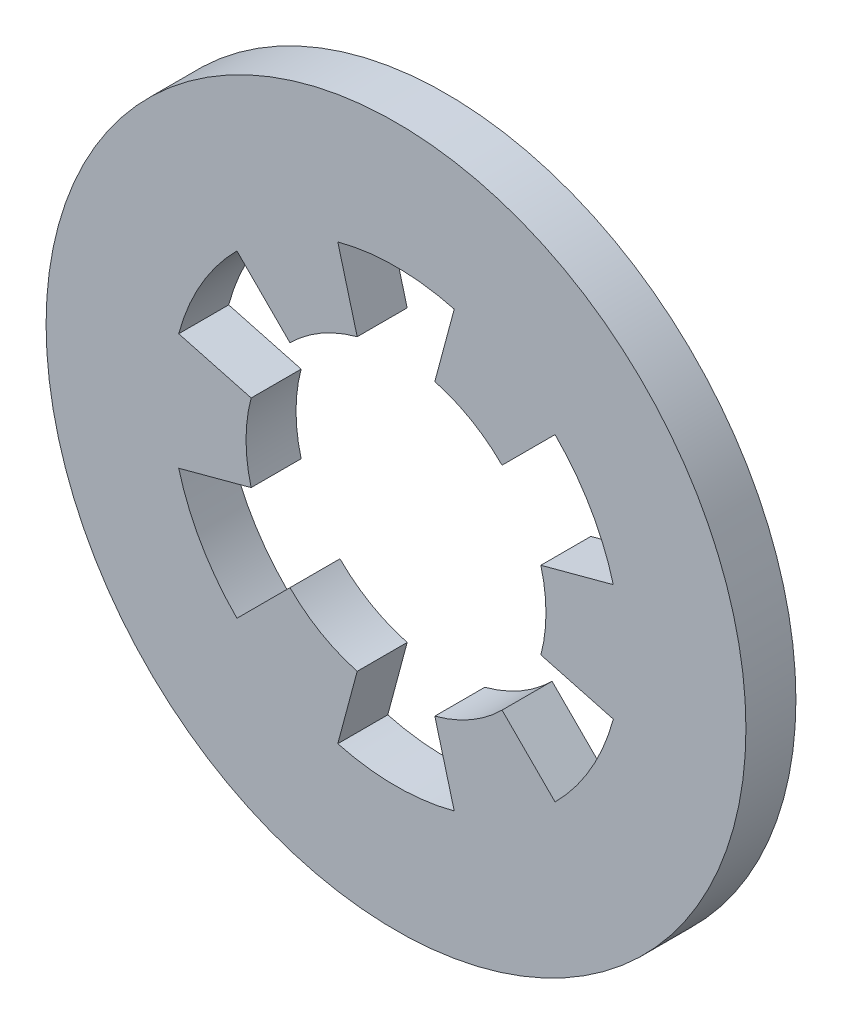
ISO-10303-21;
HEADER;
FILE_DESCRIPTION(('STEP AP214'),'2;1');
FILE_NAME('part.step','',(''),(''),'','','');
FILE_SCHEMA(('AUTOMOTIVE_DESIGN { 1 0 10303 214 1 1 1 1 }'));
ENDSEC;
DATA;
#1=APPLICATION_CONTEXT('core data for automotive mechanical design processes');
#2=APPLICATION_PROTOCOL_DEFINITION('international standard','automotive_design',2000,#1);
#3=PRODUCT_CONTEXT('',#1,'mechanical');
#4=PRODUCT('Part','Part','',(#3));
#5=PRODUCT_RELATED_PRODUCT_CATEGORY('part','',(#4));
#6=PRODUCT_DEFINITION_FORMATION('','',#4);
#7=PRODUCT_DEFINITION_CONTEXT('part definition',#1,'design');
#8=PRODUCT_DEFINITION('design','',#6,#7);
#9=PRODUCT_DEFINITION_SHAPE('','',#8);
#10=(LENGTH_UNIT() NAMED_UNIT(*) SI_UNIT(.MILLI.,.METRE.));
#11=(NAMED_UNIT(*) PLANE_ANGLE_UNIT() SI_UNIT($,.RADIAN.));
#12=(NAMED_UNIT(*) SI_UNIT($,.STERADIAN.) SOLID_ANGLE_UNIT());
#13=UNCERTAINTY_MEASURE_WITH_UNIT(LENGTH_MEASURE(1.E-05),#10,'distance_accuracy_value','');
#14=(GEOMETRIC_REPRESENTATION_CONTEXT(3) GLOBAL_UNCERTAINTY_ASSIGNED_CONTEXT((#13)) GLOBAL_UNIT_ASSIGNED_CONTEXT((#10,
#11,#12)) REPRESENTATION_CONTEXT('',''));
#15=CARTESIAN_POINT('',(0.,0.,0.));
#16=DIRECTION('',(0.,0.,1.));
#17=DIRECTION('',(1.,0.,0.));
#18=AXIS2_PLACEMENT_3D('',#15,#16,#17);
#19=CARTESIAN_POINT('',(0.,0.,-0.25));
#20=DIRECTION('',(0.,0.,-1.));
#21=DIRECTION('',(-1.,0.,0.));
#22=AXIS2_PLACEMENT_3D('',#19,#20,#21);
#23=PLANE('',#22);
#24=DIRECTION('',(-0.258819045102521,0.965925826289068,0.));
#25=VECTOR('',#24,1.);
#26=CARTESIAN_POINT('',(0.582342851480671,-2.1733331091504,-0.25));
#27=LINE('',#26,#25);
#28=CARTESIAN_POINT('',(0.582342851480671,-2.1733331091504,-0.25));
#29=VERTEX_POINT('',#28);
#30=CARTESIAN_POINT('',(0.38822856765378,-1.4488887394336,-0.25));
#31=VERTEX_POINT('',#30);
#32=EDGE_CURVE('E200',#29,#31,#27,.T.);
#33=ORIENTED_EDGE('',*,*,#32,.T.);
#34=CARTESIAN_POINT('',(0.,0.,-0.25));
#35=DIRECTION('',(0.,0.,1.));
#36=DIRECTION('',(1.,0.,0.));
#37=AXIS2_PLACEMENT_3D('',#34,#35,#36);
#38=CIRCLE('',#37,1.5);
#39=CARTESIAN_POINT('',(1.06066017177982,-1.06066017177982,-0.25));
#40=VERTEX_POINT('',#39);
#41=EDGE_CURVE('E187',#31,#40,#38,.T.);
#42=ORIENTED_EDGE('',*,*,#41,.T.);
#43=DIRECTION('',(0.707106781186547,-0.707106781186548,0.));
#44=VECTOR('',#43,1.);
#45=CARTESIAN_POINT('',(0.,0.,-0.25));
#46=LINE('',#45,#44);
#47=CARTESIAN_POINT('',(1.59099025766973,-1.59099025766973,-0.25));
#48=VERTEX_POINT('',#47);
#49=EDGE_CURVE('E186',#40,#48,#46,.T.);
#50=ORIENTED_EDGE('',*,*,#49,.T.);
#51=CARTESIAN_POINT('',(0.,0.,-0.25));
#52=DIRECTION('',(0.,0.,-1.));
#53=DIRECTION('',(-1.,0.,0.));
#54=AXIS2_PLACEMENT_3D('',#51,#52,#53);
#55=CIRCLE('',#54,2.25);
#56=CARTESIAN_POINT('',(2.1733331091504,-0.582342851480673,-0.25));
#57=VERTEX_POINT('',#56);
#58=EDGE_CURVE('E175',#48,#57,#55,.F.);
#59=ORIENTED_EDGE('',*,*,#58,.T.);
#60=DIRECTION('',(-0.965925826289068,0.258819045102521,0.));
#61=VECTOR('',#60,1.);
#62=CARTESIAN_POINT('',(2.1733331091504,-0.582342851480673,-0.25));
#63=LINE('',#62,#61);
#64=CARTESIAN_POINT('',(1.4488887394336,-0.388228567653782,-0.25));
#65=VERTEX_POINT('',#64);
#66=EDGE_CURVE('E241',#57,#65,#63,.T.);
#67=ORIENTED_EDGE('',*,*,#66,.T.);
#68=CARTESIAN_POINT('',(0.,0.,-0.25));
#69=DIRECTION('',(0.,0.,1.));
#70=DIRECTION('',(1.,0.,0.));
#71=AXIS2_PLACEMENT_3D('',#68,#69,#70);
#72=CIRCLE('',#71,1.5);
#73=CARTESIAN_POINT('',(1.4488887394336,0.38822856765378,-0.25));
#74=VERTEX_POINT('',#73);
#75=EDGE_CURVE('E243',#65,#74,#72,.T.);
#76=ORIENTED_EDGE('',*,*,#75,.T.);
#77=DIRECTION('',(0.965925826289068,0.25881904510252,0.));
#78=VECTOR('',#77,1.);
#79=CARTESIAN_POINT('',(0.,0.,-0.25));
#80=LINE('',#79,#78);
#81=CARTESIAN_POINT('',(2.1733331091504,0.582342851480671,-0.25));
#82=VERTEX_POINT('',#81);
#83=EDGE_CURVE('E237',#74,#82,#80,.T.);
#84=ORIENTED_EDGE('',*,*,#83,.T.);
#85=CARTESIAN_POINT('',(0.,0.,-0.25));
#86=DIRECTION('',(0.,0.,-1.));
#87=DIRECTION('',(-1.,0.,0.));
#88=AXIS2_PLACEMENT_3D('',#85,#86,#87);
#89=CIRCLE('',#88,2.25);
#90=CARTESIAN_POINT('',(1.59099025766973,1.59099025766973,-0.25));
#91=VERTEX_POINT('',#90);
#92=EDGE_CURVE('E305',#82,#91,#89,.F.);
#93=ORIENTED_EDGE('',*,*,#92,.T.);
#94=DIRECTION('',(-0.707106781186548,-0.707106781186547,0.));
#95=VECTOR('',#94,1.);
#96=CARTESIAN_POINT('',(1.59099025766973,1.59099025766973,-0.25));
#97=LINE('',#96,#95);
#98=CARTESIAN_POINT('',(1.06066017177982,1.06066017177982,-0.25));
#99=VERTEX_POINT('',#98);
#100=EDGE_CURVE('E232',#91,#99,#97,.T.);
#101=ORIENTED_EDGE('',*,*,#100,.T.);
#102=CARTESIAN_POINT('',(0.,0.,-0.25));
#103=DIRECTION('',(0.,0.,1.));
#104=DIRECTION('',(1.,0.,0.));
#105=AXIS2_PLACEMENT_3D('',#102,#103,#104);
#106=CIRCLE('',#105,1.5);
#107=CARTESIAN_POINT('',(0.38822856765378,1.4488887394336,-0.25));
#108=VERTEX_POINT('',#107);
#109=EDGE_CURVE('E235',#99,#108,#106,.T.);
#110=ORIENTED_EDGE('',*,*,#109,.T.);
#111=DIRECTION('',(0.25881904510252,0.965925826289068,0.));
#112=VECTOR('',#111,1.);
#113=CARTESIAN_POINT('',(0.,0.,-0.25));
#114=LINE('',#113,#112);
#115=CARTESIAN_POINT('',(0.582342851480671,2.1733331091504,-0.25));
#116=VERTEX_POINT('',#115);
#117=EDGE_CURVE('E228',#108,#116,#114,.T.);
#118=ORIENTED_EDGE('',*,*,#117,.T.);
#119=CARTESIAN_POINT('',(0.,0.,-0.25));
#120=DIRECTION('',(0.,0.,-1.));
#121=DIRECTION('',(-1.,0.,0.));
#122=AXIS2_PLACEMENT_3D('',#119,#120,#121);
#123=CIRCLE('',#122,2.25);
#124=CARTESIAN_POINT('',(-0.582342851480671,2.1733331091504,-0.25));
#125=VERTEX_POINT('',#124);
#126=EDGE_CURVE('E301',#116,#125,#123,.F.);
#127=ORIENTED_EDGE('',*,*,#126,.T.);
#128=DIRECTION('',(0.258819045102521,-0.965925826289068,0.));
#129=VECTOR('',#128,1.);
#130=CARTESIAN_POINT('',(-0.582342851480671,2.1733331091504,-0.25));
#131=LINE('',#130,#129);
#132=CARTESIAN_POINT('',(-0.388228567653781,1.4488887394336,-0.25));
#133=VERTEX_POINT('',#132);
#134=EDGE_CURVE('E224',#125,#133,#131,.T.);
#135=ORIENTED_EDGE('',*,*,#134,.T.);
#136=CARTESIAN_POINT('',(0.,0.,-0.25));
#137=DIRECTION('',(0.,0.,1.));
#138=DIRECTION('',(1.,0.,0.));
#139=AXIS2_PLACEMENT_3D('',#136,#137,#138);
#140=CIRCLE('',#139,1.5);
#141=CARTESIAN_POINT('',(-1.06066017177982,1.06066017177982,-0.25));
#142=VERTEX_POINT('',#141);
#143=EDGE_CURVE('E299',#133,#142,#140,.T.);
#144=ORIENTED_EDGE('',*,*,#143,.T.);
#145=DIRECTION('',(-0.707106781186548,0.707106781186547,0.));
#146=VECTOR('',#145,1.);
#147=CARTESIAN_POINT('',(0.,0.,-0.25));
#148=LINE('',#147,#146);
#149=CARTESIAN_POINT('',(-1.59099025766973,1.59099025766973,-0.25));
#150=VERTEX_POINT('',#149);
#151=EDGE_CURVE('E220',#142,#150,#148,.T.);
#152=ORIENTED_EDGE('',*,*,#151,.T.);
#153=CARTESIAN_POINT('',(0.,0.,-0.25));
#154=DIRECTION('',(0.,0.,-1.));
#155=DIRECTION('',(-1.,0.,0.));
#156=AXIS2_PLACEMENT_3D('',#153,#154,#155);
#157=CIRCLE('',#156,2.25);
#158=CARTESIAN_POINT('',(-2.1733331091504,0.582342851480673,-0.25));
#159=VERTEX_POINT('',#158);
#160=EDGE_CURVE('E297',#150,#159,#157,.F.);
#161=ORIENTED_EDGE('',*,*,#160,.T.);
#162=DIRECTION('',(0.965925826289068,-0.258819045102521,0.));
#163=VECTOR('',#162,1.);
#164=CARTESIAN_POINT('',(-2.1733331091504,0.582342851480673,-0.25));
#165=LINE('',#164,#163);
#166=CARTESIAN_POINT('',(-1.4488887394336,0.388228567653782,-0.25));
#167=VERTEX_POINT('',#166);
#168=EDGE_CURVE('E216',#159,#167,#165,.T.);
#169=ORIENTED_EDGE('',*,*,#168,.T.);
#170=CARTESIAN_POINT('',(0.,0.,-0.25));
#171=DIRECTION('',(0.,0.,1.));
#172=DIRECTION('',(1.,0.,0.));
#173=AXIS2_PLACEMENT_3D('',#170,#171,#172);
#174=CIRCLE('',#173,1.5);
#175=CARTESIAN_POINT('',(-1.4488887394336,-0.388228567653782,-0.25));
#176=VERTEX_POINT('',#175);
#177=EDGE_CURVE('E295',#167,#176,#174,.T.);
#178=ORIENTED_EDGE('',*,*,#177,.T.);
#179=DIRECTION('',(-0.965925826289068,-0.258819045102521,0.));
#180=VECTOR('',#179,1.);
#181=CARTESIAN_POINT('',(0.,0.,-0.25));
#182=LINE('',#181,#180);
#183=CARTESIAN_POINT('',(-2.1733331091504,-0.582342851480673,-0.25));
#184=VERTEX_POINT('',#183);
#185=EDGE_CURVE('E212',#176,#184,#182,.T.);
#186=ORIENTED_EDGE('',*,*,#185,.T.);
#187=CARTESIAN_POINT('',(0.,0.,-0.25));
#188=DIRECTION('',(0.,0.,-1.));
#189=DIRECTION('',(-1.,0.,0.));
#190=AXIS2_PLACEMENT_3D('',#187,#188,#189);
#191=CIRCLE('',#190,2.25);
#192=CARTESIAN_POINT('',(-1.59099025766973,-1.59099025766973,-0.25));
#193=VERTEX_POINT('',#192);
#194=EDGE_CURVE('E293',#184,#193,#191,.F.);
#195=ORIENTED_EDGE('',*,*,#194,.T.);
#196=DIRECTION('',(0.707106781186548,0.707106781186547,0.));
#197=VECTOR('',#196,1.);
#198=CARTESIAN_POINT('',(-1.59099025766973,-1.59099025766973,-0.25));
#199=LINE('',#198,#197);
#200=CARTESIAN_POINT('',(-1.06066017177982,-1.06066017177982,-0.25));
#201=VERTEX_POINT('',#200);
#202=EDGE_CURVE('E208',#193,#201,#199,.T.);
#203=ORIENTED_EDGE('',*,*,#202,.T.);
#204=CARTESIAN_POINT('',(0.,0.,-0.25));
#205=DIRECTION('',(0.,0.,1.));
#206=DIRECTION('',(1.,0.,0.));
#207=AXIS2_PLACEMENT_3D('',#204,#205,#206);
#208=CIRCLE('',#207,1.5);
#209=CARTESIAN_POINT('',(-0.388228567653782,-1.4488887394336,-0.25));
#210=VERTEX_POINT('',#209);
#211=EDGE_CURVE('E291',#201,#210,#208,.T.);
#212=ORIENTED_EDGE('',*,*,#211,.T.);
#213=DIRECTION('',(-0.258819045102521,-0.965925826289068,0.));
#214=VECTOR('',#213,1.);
#215=CARTESIAN_POINT('',(0.,0.,-0.25));
#216=LINE('',#215,#214);
#217=CARTESIAN_POINT('',(-0.582342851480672,-2.1733331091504,-0.25));
#218=VERTEX_POINT('',#217);
#219=EDGE_CURVE('E204',#210,#218,#216,.T.);
#220=ORIENTED_EDGE('',*,*,#219,.T.);
#221=CARTESIAN_POINT('',(0.,0.,-0.25));
#222=DIRECTION('',(0.,0.,-1.));
#223=DIRECTION('',(-1.,0.,0.));
#224=AXIS2_PLACEMENT_3D('',#221,#222,#223);
#225=CIRCLE('',#224,2.25);
#226=EDGE_CURVE('E289',#218,#29,#225,.F.);
#227=ORIENTED_EDGE('',*,*,#226,.T.);
#228=EDGE_LOOP('',(#33,#42,#50,#59,#67,#76,#84,#93,#101,#110,#118,#127,#135,#144,#152,#161,#169,
#178,#186,#195,#203,#212,#220,#227));
#229=FACE_BOUND('',#228,.T.);
#230=CARTESIAN_POINT('',(0.,0.,-0.25));
#231=DIRECTION('',(0.,0.,1.));
#232=DIRECTION('',(1.,0.,0.));
#233=AXIS2_PLACEMENT_3D('',#230,#231,#232);
#234=CIRCLE('',#233,3.5);
#235=CARTESIAN_POINT('',(3.5,0.,-0.25));
#236=VERTEX_POINT('',#235);
#237=EDGE_CURVE('E19',#236,#236,#234,.T.);
#238=ORIENTED_EDGE('',*,*,#237,.F.);
#239=EDGE_LOOP('',(#238));
#240=FACE_BOUND('',#239,.T.);
#241=ADVANCED_FACE('F15',(#229,#240),#23,.T.);
#242=CARTESIAN_POINT('',(0.,0.,0.));
#243=DIRECTION('',(0.,0.,1.));
#244=DIRECTION('',(1.,0.,0.));
#245=AXIS2_PLACEMENT_3D('',#242,#243,#244);
#246=CYLINDRICAL_SURFACE('',#245,3.5);
#247=CARTESIAN_POINT('',(0.,0.,0.25));
#248=DIRECTION('',(0.,0.,1.));
#249=DIRECTION('',(1.,0.,0.));
#250=AXIS2_PLACEMENT_3D('',#247,#248,#249);
#251=CIRCLE('',#250,3.5);
#252=CARTESIAN_POINT('',(3.5,0.,0.25));
#253=VERTEX_POINT('',#252);
#254=EDGE_CURVE('E191',#253,#253,#251,.F.);
#255=ORIENTED_EDGE('',*,*,#254,.T.);
#256=EDGE_LOOP('',(#255));
#257=FACE_BOUND('',#256,.T.);
#258=ORIENTED_EDGE('',*,*,#237,.T.);
#259=EDGE_LOOP('',(#258));
#260=FACE_BOUND('',#259,.T.);
#261=ADVANCED_FACE('F610',(#257,#260),#246,.T.);
#262=CARTESIAN_POINT('',(0.,0.,0.25));
#263=DIRECTION('',(0.,0.,-1.));
#264=DIRECTION('',(-1.,0.,0.));
#265=AXIS2_PLACEMENT_3D('',#262,#263,#264);
#266=CYLINDRICAL_SURFACE('',#265,2.25);
#267=DIRECTION('',(0.,0.,1.));
#268=VECTOR('',#267,1.);
#269=CARTESIAN_POINT('',(1.59099025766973,-1.59099025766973,0.25));
#270=LINE('',#269,#268);
#271=CARTESIAN_POINT('',(1.59099025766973,-1.59099025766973,0.25));
#272=VERTEX_POINT('',#271);
#273=EDGE_CURVE('E179',#48,#272,#270,.T.);
#274=ORIENTED_EDGE('',*,*,#273,.T.);
#275=CARTESIAN_POINT('',(0.,0.,0.25));
#276=DIRECTION('',(0.,0.,-1.));
#277=DIRECTION('',(-1.,0.,0.));
#278=AXIS2_PLACEMENT_3D('',#275,#276,#277);
#279=CIRCLE('',#278,2.25);
#280=CARTESIAN_POINT('',(2.1733331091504,-0.582342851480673,0.25));
#281=VERTEX_POINT('',#280);
#282=EDGE_CURVE('E194',#272,#281,#279,.F.);
#283=ORIENTED_EDGE('',*,*,#282,.T.);
#284=DIRECTION('',(0.,0.,1.));
#285=VECTOR('',#284,1.);
#286=CARTESIAN_POINT('',(2.1733331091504,-0.582342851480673,0.25));
#287=LINE('',#286,#285);
#288=EDGE_CURVE('E180',#281,#57,#287,.F.);
#289=ORIENTED_EDGE('',*,*,#288,.T.);
#290=ORIENTED_EDGE('',*,*,#58,.F.);
#291=EDGE_LOOP('',(#274,#283,#289,#290));
#292=FACE_BOUND('',#291,.T.);
#293=ADVANCED_FACE('F177',(#292),#266,.F.);
#294=CARTESIAN_POINT('',(2.1733331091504,-0.582342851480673,0.25));
#295=DIRECTION('',(0.258819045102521,0.965925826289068,0.));
#296=DIRECTION('',(-0.965925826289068,0.258819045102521,0.));
#297=AXIS2_PLACEMENT_3D('',#294,#295,#296);
#298=PLANE('',#297);
#299=ORIENTED_EDGE('',*,*,#288,.F.);
#300=DIRECTION('',(-0.965925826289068,0.258819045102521,0.));
#301=VECTOR('',#300,1.);
#302=CARTESIAN_POINT('',(2.1733331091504,-0.582342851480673,0.25));
#303=LINE('',#302,#301);
#304=CARTESIAN_POINT('',(1.4488887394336,-0.388228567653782,0.25));
#305=VERTEX_POINT('',#304);
#306=EDGE_CURVE('E286',#281,#305,#303,.T.);
#307=ORIENTED_EDGE('',*,*,#306,.T.);
#308=DIRECTION('',(0.,0.,1.));
#309=VECTOR('',#308,1.);
#310=CARTESIAN_POINT('',(1.4488887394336,-0.388228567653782,0.));
#311=LINE('',#310,#309);
#312=EDGE_CURVE('E307',#305,#65,#311,.F.);
#313=ORIENTED_EDGE('',*,*,#312,.T.);
#314=ORIENTED_EDGE('',*,*,#66,.F.);
#315=EDGE_LOOP('',(#299,#307,#313,#314));
#316=FACE_BOUND('',#315,.T.);
#317=ADVANCED_FACE('F454',(#316),#298,.F.);
#318=CARTESIAN_POINT('',(0.,0.,0.));
#319=DIRECTION('',(0.,0.,1.));
#320=DIRECTION('',(1.,0.,0.));
#321=AXIS2_PLACEMENT_3D('',#318,#319,#320);
#322=CYLINDRICAL_SURFACE('',#321,1.5);
#323=CARTESIAN_POINT('',(0.,0.,0.25));
#324=DIRECTION('',(0.,0.,1.));
#325=DIRECTION('',(1.,0.,0.));
#326=AXIS2_PLACEMENT_3D('',#323,#324,#325);
#327=CIRCLE('',#326,1.5);
#328=CARTESIAN_POINT('',(1.4488887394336,0.388228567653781,0.25));
#329=VERTEX_POINT('',#328);
#330=EDGE_CURVE('E283',#305,#329,#327,.T.);
#331=ORIENTED_EDGE('',*,*,#330,.T.);
#332=DIRECTION('',(0.,0.,1.));
#333=VECTOR('',#332,1.);
#334=CARTESIAN_POINT('',(1.4488887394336,0.38822856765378,0.25));
#335=LINE('',#334,#333);
#336=EDGE_CURVE('E240',#329,#74,#335,.F.);
#337=ORIENTED_EDGE('',*,*,#336,.T.);
#338=ORIENTED_EDGE('',*,*,#75,.F.);
#339=ORIENTED_EDGE('',*,*,#312,.F.);
#340=EDGE_LOOP('',(#331,#337,#338,#339));
#341=FACE_BOUND('',#340,.T.);
#342=ADVANCED_FACE('F453',(#341),#322,.F.);
#343=CARTESIAN_POINT('',(0.,0.,0.25));
#344=DIRECTION('',(0.25881904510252,-0.965925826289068,0.));
#345=DIRECTION('',(0.965925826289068,0.25881904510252,0.));
#346=AXIS2_PLACEMENT_3D('',#343,#344,#345);
#347=PLANE('',#346);
#348=ORIENTED_EDGE('',*,*,#336,.F.);
#349=DIRECTION('',(0.965925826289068,0.25881904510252,0.));
#350=VECTOR('',#349,1.);
#351=CARTESIAN_POINT('',(1.4488887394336,0.388228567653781,0.25));
#352=LINE('',#351,#350);
#353=CARTESIAN_POINT('',(2.1733331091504,0.582342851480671,0.25));
#354=VERTEX_POINT('',#353);
#355=EDGE_CURVE('E282',#329,#354,#352,.T.);
#356=ORIENTED_EDGE('',*,*,#355,.T.);
#357=DIRECTION('',(0.,0.,-1.));
#358=VECTOR('',#357,1.);
#359=CARTESIAN_POINT('',(2.1733331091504,0.582342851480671,0.25));
#360=LINE('',#359,#358);
#361=EDGE_CURVE('E239',#354,#82,#360,.T.);
#362=ORIENTED_EDGE('',*,*,#361,.T.);
#363=ORIENTED_EDGE('',*,*,#83,.F.);
#364=EDGE_LOOP('',(#348,#356,#362,#363));
#365=FACE_BOUND('',#364,.T.);
#366=ADVANCED_FACE('F449',(#365),#347,.F.);
#367=CARTESIAN_POINT('',(0.,0.,0.25));
#368=DIRECTION('',(0.,0.,-1.));
#369=DIRECTION('',(-1.,0.,0.));
#370=AXIS2_PLACEMENT_3D('',#367,#368,#369);
#371=CYLINDRICAL_SURFACE('',#370,2.25);
#372=ORIENTED_EDGE('',*,*,#361,.F.);
#373=CARTESIAN_POINT('',(0.,0.,0.25));
#374=DIRECTION('',(0.,0.,-1.));
#375=DIRECTION('',(-1.,0.,0.));
#376=AXIS2_PLACEMENT_3D('',#373,#374,#375);
#377=CIRCLE('',#376,2.25);
#378=CARTESIAN_POINT('',(1.59099025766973,1.59099025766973,0.25));
#379=VERTEX_POINT('',#378);
#380=EDGE_CURVE('E279',#354,#379,#377,.F.);
#381=ORIENTED_EDGE('',*,*,#380,.T.);
#382=DIRECTION('',(0.,0.,1.));
#383=VECTOR('',#382,1.);
#384=CARTESIAN_POINT('',(1.59099025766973,1.59099025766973,0.25));
#385=LINE('',#384,#383);
#386=EDGE_CURVE('E236',#379,#91,#385,.F.);
#387=ORIENTED_EDGE('',*,*,#386,.T.);
#388=ORIENTED_EDGE('',*,*,#92,.F.);
#389=EDGE_LOOP('',(#372,#381,#387,#388));
#390=FACE_BOUND('',#389,.T.);
#391=ADVANCED_FACE('F446',(#390),#371,.F.);
#392=CARTESIAN_POINT('',(1.59099025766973,1.59099025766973,0.25));
#393=DIRECTION('',(-0.707106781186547,0.707106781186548,0.));
#394=DIRECTION('',(-0.707106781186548,-0.707106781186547,0.));
#395=AXIS2_PLACEMENT_3D('',#392,#393,#394);
#396=PLANE('',#395);
#397=ORIENTED_EDGE('',*,*,#386,.F.);
#398=DIRECTION('',(-0.707106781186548,-0.707106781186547,0.));
#399=VECTOR('',#398,1.);
#400=CARTESIAN_POINT('',(1.59099025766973,1.59099025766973,0.25));
#401=LINE('',#400,#399);
#402=CARTESIAN_POINT('',(1.06066017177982,1.06066017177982,0.25));
#403=VERTEX_POINT('',#402);
#404=EDGE_CURVE('E278',#379,#403,#401,.T.);
#405=ORIENTED_EDGE('',*,*,#404,.T.);
#406=DIRECTION('',(0.,0.,1.));
#407=VECTOR('',#406,1.);
#408=CARTESIAN_POINT('',(1.06066017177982,1.06066017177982,0.));
#409=LINE('',#408,#407);
#410=EDGE_CURVE('E304',#403,#99,#409,.F.);
#411=ORIENTED_EDGE('',*,*,#410,.T.);
#412=ORIENTED_EDGE('',*,*,#100,.F.);
#413=EDGE_LOOP('',(#397,#405,#411,#412));
#414=FACE_BOUND('',#413,.T.);
#415=ADVANCED_FACE('F442',(#414),#396,.F.);
#416=CARTESIAN_POINT('',(0.,0.,0.));
#417=DIRECTION('',(0.,0.,1.));
#418=DIRECTION('',(1.,0.,0.));
#419=AXIS2_PLACEMENT_3D('',#416,#417,#418);
#420=CYLINDRICAL_SURFACE('',#419,1.5);
#421=CARTESIAN_POINT('',(0.,0.,0.25));
#422=DIRECTION('',(0.,0.,1.));
#423=DIRECTION('',(1.,0.,0.));
#424=AXIS2_PLACEMENT_3D('',#421,#422,#423);
#425=CIRCLE('',#424,1.5);
#426=CARTESIAN_POINT('',(0.388228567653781,1.4488887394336,0.25));
#427=VERTEX_POINT('',#426);
#428=EDGE_CURVE('E275',#403,#427,#425,.T.);
#429=ORIENTED_EDGE('',*,*,#428,.T.);
#430=DIRECTION('',(0.,0.,1.));
#431=VECTOR('',#430,1.);
#432=CARTESIAN_POINT('',(0.38822856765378,1.4488887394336,0.25));
#433=LINE('',#432,#431);
#434=EDGE_CURVE('E231',#427,#108,#433,.F.);
#435=ORIENTED_EDGE('',*,*,#434,.T.);
#436=ORIENTED_EDGE('',*,*,#109,.F.);
#437=ORIENTED_EDGE('',*,*,#410,.F.);
#438=EDGE_LOOP('',(#429,#435,#436,#437));
#439=FACE_BOUND('',#438,.T.);
#440=ADVANCED_FACE('F439',(#439),#420,.F.);
#441=CARTESIAN_POINT('',(0.,0.,0.25));
#442=DIRECTION('',(0.965925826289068,-0.25881904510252,0.));
#443=DIRECTION('',(0.25881904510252,0.965925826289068,0.));
#444=AXIS2_PLACEMENT_3D('',#441,#442,#443);
#445=PLANE('',#444);
#446=ORIENTED_EDGE('',*,*,#434,.F.);
#447=DIRECTION('',(0.25881904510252,0.965925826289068,0.));
#448=VECTOR('',#447,1.);
#449=CARTESIAN_POINT('',(0.388228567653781,1.4488887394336,0.25));
#450=LINE('',#449,#448);
#451=CARTESIAN_POINT('',(0.582342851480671,2.1733331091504,0.25));
#452=VERTEX_POINT('',#451);
#453=EDGE_CURVE('E274',#427,#452,#450,.T.);
#454=ORIENTED_EDGE('',*,*,#453,.T.);
#455=DIRECTION('',(0.,0.,-1.));
#456=VECTOR('',#455,1.);
#457=CARTESIAN_POINT('',(0.582342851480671,2.1733331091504,0.25));
#458=LINE('',#457,#456);
#459=EDGE_CURVE('E230',#452,#116,#458,.T.);
#460=ORIENTED_EDGE('',*,*,#459,.T.);
#461=ORIENTED_EDGE('',*,*,#117,.F.);
#462=EDGE_LOOP('',(#446,#454,#460,#461));
#463=FACE_BOUND('',#462,.T.);
#464=ADVANCED_FACE('F435',(#463),#445,.F.);
#465=CARTESIAN_POINT('',(0.,0.,0.25));
#466=DIRECTION('',(0.,0.,-1.));
#467=DIRECTION('',(-1.,0.,0.));
#468=AXIS2_PLACEMENT_3D('',#465,#466,#467);
#469=CYLINDRICAL_SURFACE('',#468,2.25);
#470=ORIENTED_EDGE('',*,*,#459,.F.);
#471=CARTESIAN_POINT('',(0.,0.,0.25));
#472=DIRECTION('',(0.,0.,-1.));
#473=DIRECTION('',(-1.,0.,0.));
#474=AXIS2_PLACEMENT_3D('',#471,#472,#473);
#475=CIRCLE('',#474,2.25);
#476=CARTESIAN_POINT('',(-0.582342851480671,2.1733331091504,0.25));
#477=VERTEX_POINT('',#476);
#478=EDGE_CURVE('E271',#452,#477,#475,.F.);
#479=ORIENTED_EDGE('',*,*,#478,.T.);
#480=DIRECTION('',(0.,0.,1.));
#481=VECTOR('',#480,1.);
#482=CARTESIAN_POINT('',(-0.582342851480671,2.1733331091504,0.25));
#483=LINE('',#482,#481);
#484=EDGE_CURVE('E227',#477,#125,#483,.F.);
#485=ORIENTED_EDGE('',*,*,#484,.T.);
#486=ORIENTED_EDGE('',*,*,#126,.F.);
#487=EDGE_LOOP('',(#470,#479,#485,#486));
#488=FACE_BOUND('',#487,.T.);
#489=ADVANCED_FACE('F431',(#488),#469,.F.);
#490=CARTESIAN_POINT('',(-0.582342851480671,2.1733331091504,0.25));
#491=DIRECTION('',(-0.965925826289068,-0.258819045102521,0.));
#492=DIRECTION('',(0.258819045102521,-0.965925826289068,0.));
#493=AXIS2_PLACEMENT_3D('',#490,#491,#492);
#494=PLANE('',#493);
#495=ORIENTED_EDGE('',*,*,#484,.F.);
#496=DIRECTION('',(0.25881904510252,-0.965925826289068,0.));
#497=VECTOR('',#496,1.);
#498=CARTESIAN_POINT('',(-0.582342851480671,2.1733331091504,0.25));
#499=LINE('',#498,#497);
#500=CARTESIAN_POINT('',(-0.388228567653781,1.4488887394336,0.25));
#501=VERTEX_POINT('',#500);
#502=EDGE_CURVE('E270',#477,#501,#499,.T.);
#503=ORIENTED_EDGE('',*,*,#502,.T.);
#504=DIRECTION('',(0.,0.,1.));
#505=VECTOR('',#504,1.);
#506=CARTESIAN_POINT('',(-0.388228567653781,1.4488887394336,0.));
#507=LINE('',#506,#505);
#508=EDGE_CURVE('E226',#501,#133,#507,.F.);
#509=ORIENTED_EDGE('',*,*,#508,.T.);
#510=ORIENTED_EDGE('',*,*,#134,.F.);
#511=EDGE_LOOP('',(#495,#503,#509,#510));
#512=FACE_BOUND('',#511,.T.);
#513=ADVANCED_FACE('F427',(#512),#494,.F.);
#514=CARTESIAN_POINT('',(0.,0.,0.));
#515=DIRECTION('',(0.,0.,1.));
#516=DIRECTION('',(1.,0.,0.));
#517=AXIS2_PLACEMENT_3D('',#514,#515,#516);
#518=CYLINDRICAL_SURFACE('',#517,1.5);
#519=ORIENTED_EDGE('',*,*,#143,.F.);
#520=ORIENTED_EDGE('',*,*,#508,.F.);
#521=CARTESIAN_POINT('',(0.,0.,0.25));
#522=DIRECTION('',(0.,0.,1.));
#523=DIRECTION('',(1.,0.,0.));
#524=AXIS2_PLACEMENT_3D('',#521,#522,#523);
#525=CIRCLE('',#524,1.5);
#526=CARTESIAN_POINT('',(-1.06066017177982,1.06066017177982,0.25));
#527=VERTEX_POINT('',#526);
#528=EDGE_CURVE('E267',#501,#527,#525,.T.);
#529=ORIENTED_EDGE('',*,*,#528,.T.);
#530=DIRECTION('',(0.,0.,1.));
#531=VECTOR('',#530,1.);
#532=CARTESIAN_POINT('',(-1.06066017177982,1.06066017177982,0.25));
#533=LINE('',#532,#531);
#534=EDGE_CURVE('E223',#527,#142,#533,.F.);
#535=ORIENTED_EDGE('',*,*,#534,.T.);
#536=EDGE_LOOP('',(#519,#520,#529,#535));
#537=FACE_BOUND('',#536,.T.);
#538=ADVANCED_FACE('F424',(#537),#518,.F.);
#539=CARTESIAN_POINT('',(0.,0.,0.25));
#540=DIRECTION('',(0.707106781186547,0.707106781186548,0.));
#541=DIRECTION('',(-0.707106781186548,0.707106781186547,0.));
#542=AXIS2_PLACEMENT_3D('',#539,#540,#541);
#543=PLANE('',#542);
#544=ORIENTED_EDGE('',*,*,#534,.F.);
#545=DIRECTION('',(-0.707106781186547,0.707106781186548,0.));
#546=VECTOR('',#545,1.);
#547=CARTESIAN_POINT('',(-1.06066017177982,1.06066017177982,0.25));
#548=LINE('',#547,#546);
#549=CARTESIAN_POINT('',(-1.59099025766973,1.59099025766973,0.25));
#550=VERTEX_POINT('',#549);
#551=EDGE_CURVE('E266',#527,#550,#548,.T.);
#552=ORIENTED_EDGE('',*,*,#551,.T.);
#553=DIRECTION('',(0.,0.,-1.));
#554=VECTOR('',#553,1.);
#555=CARTESIAN_POINT('',(-1.59099025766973,1.59099025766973,0.25));
#556=LINE('',#555,#554);
#557=EDGE_CURVE('E222',#550,#150,#556,.T.);
#558=ORIENTED_EDGE('',*,*,#557,.T.);
#559=ORIENTED_EDGE('',*,*,#151,.F.);
#560=EDGE_LOOP('',(#544,#552,#558,#559));
#561=FACE_BOUND('',#560,.T.);
#562=ADVANCED_FACE('F419',(#561),#543,.F.);
#563=CARTESIAN_POINT('',(0.,0.,0.25));
#564=DIRECTION('',(0.,0.,-1.));
#565=DIRECTION('',(-1.,0.,0.));
#566=AXIS2_PLACEMENT_3D('',#563,#564,#565);
#567=CYLINDRICAL_SURFACE('',#566,2.25);
#568=ORIENTED_EDGE('',*,*,#557,.F.);
#569=CARTESIAN_POINT('',(0.,0.,0.25));
#570=DIRECTION('',(0.,0.,-1.));
#571=DIRECTION('',(-1.,0.,0.));
#572=AXIS2_PLACEMENT_3D('',#569,#570,#571);
#573=CIRCLE('',#572,2.25);
#574=CARTESIAN_POINT('',(-2.1733331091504,0.582342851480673,0.25));
#575=VERTEX_POINT('',#574);
#576=EDGE_CURVE('E263',#550,#575,#573,.F.);
#577=ORIENTED_EDGE('',*,*,#576,.T.);
#578=DIRECTION('',(0.,0.,1.));
#579=VECTOR('',#578,1.);
#580=CARTESIAN_POINT('',(-2.1733331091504,0.582342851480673,0.25));
#581=LINE('',#580,#579);
#582=EDGE_CURVE('E219',#575,#159,#581,.F.);
#583=ORIENTED_EDGE('',*,*,#582,.T.);
#584=ORIENTED_EDGE('',*,*,#160,.F.);
#585=EDGE_LOOP('',(#568,#577,#583,#584));
#586=FACE_BOUND('',#585,.T.);
#587=ADVANCED_FACE('F415',(#586),#567,.F.);
#588=CARTESIAN_POINT('',(-2.1733331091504,0.582342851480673,0.25));
#589=DIRECTION('',(-0.258819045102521,-0.965925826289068,0.));
#590=DIRECTION('',(0.965925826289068,-0.258819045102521,0.));
#591=AXIS2_PLACEMENT_3D('',#588,#589,#590);
#592=PLANE('',#591);
#593=ORIENTED_EDGE('',*,*,#582,.F.);
#594=DIRECTION('',(0.965925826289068,-0.258819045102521,0.));
#595=VECTOR('',#594,1.);
#596=CARTESIAN_POINT('',(-2.1733331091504,0.582342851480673,0.25));
#597=LINE('',#596,#595);
#598=CARTESIAN_POINT('',(-1.4488887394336,0.388228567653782,0.25));
#599=VERTEX_POINT('',#598);
#600=EDGE_CURVE('E262',#575,#599,#597,.T.);
#601=ORIENTED_EDGE('',*,*,#600,.T.);
#602=DIRECTION('',(0.,0.,1.));
#603=VECTOR('',#602,1.);
#604=CARTESIAN_POINT('',(-1.4488887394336,0.388228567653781,0.));
#605=LINE('',#604,#603);
#606=EDGE_CURVE('E218',#599,#167,#605,.F.);
#607=ORIENTED_EDGE('',*,*,#606,.T.);
#608=ORIENTED_EDGE('',*,*,#168,.F.);
#609=EDGE_LOOP('',(#593,#601,#607,#608));
#610=FACE_BOUND('',#609,.T.);
#611=ADVANCED_FACE('F411',(#610),#592,.F.);
#612=CARTESIAN_POINT('',(0.,0.,0.));
#613=DIRECTION('',(0.,0.,1.));
#614=DIRECTION('',(1.,0.,0.));
#615=AXIS2_PLACEMENT_3D('',#612,#613,#614);
#616=CYLINDRICAL_SURFACE('',#615,1.5);
#617=ORIENTED_EDGE('',*,*,#177,.F.);
#618=ORIENTED_EDGE('',*,*,#606,.F.);
#619=CARTESIAN_POINT('',(0.,0.,0.25));
#620=DIRECTION('',(0.,0.,1.));
#621=DIRECTION('',(1.,0.,0.));
#622=AXIS2_PLACEMENT_3D('',#619,#620,#621);
#623=CIRCLE('',#622,1.5);
#624=CARTESIAN_POINT('',(-1.4488887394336,-0.388228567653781,0.25));
#625=VERTEX_POINT('',#624);
#626=EDGE_CURVE('E259',#599,#625,#623,.T.);
#627=ORIENTED_EDGE('',*,*,#626,.T.);
#628=DIRECTION('',(0.,0.,1.));
#629=VECTOR('',#628,1.);
#630=CARTESIAN_POINT('',(-1.4488887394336,-0.388228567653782,0.25));
#631=LINE('',#630,#629);
#632=EDGE_CURVE('E215',#625,#176,#631,.F.);
#633=ORIENTED_EDGE('',*,*,#632,.T.);
#634=EDGE_LOOP('',(#617,#618,#627,#633));
#635=FACE_BOUND('',#634,.T.);
#636=ADVANCED_FACE('F408',(#635),#616,.F.);
#637=CARTESIAN_POINT('',(0.,0.,0.25));
#638=DIRECTION('',(-0.258819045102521,0.965925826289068,0.));
#639=DIRECTION('',(-0.965925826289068,-0.258819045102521,0.));
#640=AXIS2_PLACEMENT_3D('',#637,#638,#639);
#641=PLANE('',#640);
#642=ORIENTED_EDGE('',*,*,#632,.F.);
#643=DIRECTION('',(-0.965925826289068,-0.258819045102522,0.));
#644=VECTOR('',#643,1.);
#645=CARTESIAN_POINT('',(-1.4488887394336,-0.388228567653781,0.25));
#646=LINE('',#645,#644);
#647=CARTESIAN_POINT('',(-2.1733331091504,-0.582342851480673,0.25));
#648=VERTEX_POINT('',#647);
#649=EDGE_CURVE('E258',#625,#648,#646,.T.);
#650=ORIENTED_EDGE('',*,*,#649,.T.);
#651=DIRECTION('',(0.,0.,-1.));
#652=VECTOR('',#651,1.);
#653=CARTESIAN_POINT('',(-2.1733331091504,-0.582342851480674,0.25));
#654=LINE('',#653,#652);
#655=EDGE_CURVE('E214',#648,#184,#654,.T.);
#656=ORIENTED_EDGE('',*,*,#655,.T.);
#657=ORIENTED_EDGE('',*,*,#185,.F.);
#658=EDGE_LOOP('',(#642,#650,#656,#657));
#659=FACE_BOUND('',#658,.T.);
#660=ADVANCED_FACE('F403',(#659),#641,.F.);
#661=CARTESIAN_POINT('',(0.,0.,0.25));
#662=DIRECTION('',(0.,0.,-1.));
#663=DIRECTION('',(-1.,0.,0.));
#664=AXIS2_PLACEMENT_3D('',#661,#662,#663);
#665=CYLINDRICAL_SURFACE('',#664,2.25);
#666=ORIENTED_EDGE('',*,*,#655,.F.);
#667=CARTESIAN_POINT('',(0.,0.,0.25));
#668=DIRECTION('',(0.,0.,-1.));
#669=DIRECTION('',(-1.,0.,0.));
#670=AXIS2_PLACEMENT_3D('',#667,#668,#669);
#671=CIRCLE('',#670,2.25);
#672=CARTESIAN_POINT('',(-1.59099025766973,-1.59099025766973,0.25));
#673=VERTEX_POINT('',#672);
#674=EDGE_CURVE('E255',#648,#673,#671,.F.);
#675=ORIENTED_EDGE('',*,*,#674,.T.);
#676=DIRECTION('',(0.,0.,1.));
#677=VECTOR('',#676,1.);
#678=CARTESIAN_POINT('',(-1.59099025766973,-1.59099025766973,0.25));
#679=LINE('',#678,#677);
#680=EDGE_CURVE('E211',#673,#193,#679,.F.);
#681=ORIENTED_EDGE('',*,*,#680,.T.);
#682=ORIENTED_EDGE('',*,*,#194,.F.);
#683=EDGE_LOOP('',(#666,#675,#681,#682));
#684=FACE_BOUND('',#683,.T.);
#685=ADVANCED_FACE('F399',(#684),#665,.F.);
#686=CARTESIAN_POINT('',(-1.59099025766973,-1.59099025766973,0.25));
#687=DIRECTION('',(0.707106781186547,-0.707106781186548,0.));
#688=DIRECTION('',(0.707106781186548,0.707106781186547,0.));
#689=AXIS2_PLACEMENT_3D('',#686,#687,#688);
#690=PLANE('',#689);
#691=ORIENTED_EDGE('',*,*,#680,.F.);
#692=DIRECTION('',(0.707106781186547,0.707106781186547,0.));
#693=VECTOR('',#692,1.);
#694=CARTESIAN_POINT('',(-1.59099025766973,-1.59099025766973,0.25));
#695=LINE('',#694,#693);
#696=CARTESIAN_POINT('',(-1.06066017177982,-1.06066017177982,0.25));
#697=VERTEX_POINT('',#696);
#698=EDGE_CURVE('E254',#673,#697,#695,.T.);
#699=ORIENTED_EDGE('',*,*,#698,.T.);
#700=DIRECTION('',(0.,0.,1.));
#701=VECTOR('',#700,1.);
#702=CARTESIAN_POINT('',(-1.06066017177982,-1.06066017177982,0.));
#703=LINE('',#702,#701);
#704=EDGE_CURVE('E210',#697,#201,#703,.F.);
#705=ORIENTED_EDGE('',*,*,#704,.T.);
#706=ORIENTED_EDGE('',*,*,#202,.F.);
#707=EDGE_LOOP('',(#691,#699,#705,#706));
#708=FACE_BOUND('',#707,.T.);
#709=ADVANCED_FACE('F395',(#708),#690,.F.);
#710=CARTESIAN_POINT('',(0.,0.,0.));
#711=DIRECTION('',(0.,0.,1.));
#712=DIRECTION('',(1.,0.,0.));
#713=AXIS2_PLACEMENT_3D('',#710,#711,#712);
#714=CYLINDRICAL_SURFACE('',#713,1.5);
#715=ORIENTED_EDGE('',*,*,#211,.F.);
#716=ORIENTED_EDGE('',*,*,#704,.F.);
#717=CARTESIAN_POINT('',(0.,0.,0.25));
#718=DIRECTION('',(0.,0.,1.));
#719=DIRECTION('',(1.,0.,0.));
#720=AXIS2_PLACEMENT_3D('',#717,#718,#719);
#721=CIRCLE('',#720,1.5);
#722=CARTESIAN_POINT('',(-0.388228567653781,-1.4488887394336,0.25));
#723=VERTEX_POINT('',#722);
#724=EDGE_CURVE('E251',#697,#723,#721,.T.);
#725=ORIENTED_EDGE('',*,*,#724,.T.);
#726=DIRECTION('',(0.,0.,1.));
#727=VECTOR('',#726,1.);
#728=CARTESIAN_POINT('',(-0.388228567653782,-1.4488887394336,0.25));
#729=LINE('',#728,#727);
#730=EDGE_CURVE('E207',#723,#210,#729,.F.);
#731=ORIENTED_EDGE('',*,*,#730,.T.);
#732=EDGE_LOOP('',(#715,#716,#725,#731));
#733=FACE_BOUND('',#732,.T.);
#734=ADVANCED_FACE('F392',(#733),#714,.F.);
#735=CARTESIAN_POINT('',(0.,0.,0.25));
#736=DIRECTION('',(-0.965925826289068,0.258819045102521,0.));
#737=DIRECTION('',(-0.258819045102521,-0.965925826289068,0.));
#738=AXIS2_PLACEMENT_3D('',#735,#736,#737);
#739=PLANE('',#738);
#740=ORIENTED_EDGE('',*,*,#730,.F.);
#741=DIRECTION('',(-0.25881904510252,-0.965925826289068,0.));
#742=VECTOR('',#741,1.);
#743=CARTESIAN_POINT('',(-0.388228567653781,-1.4488887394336,0.25));
#744=LINE('',#743,#742);
#745=CARTESIAN_POINT('',(-0.582342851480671,-2.1733331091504,0.25));
#746=VERTEX_POINT('',#745);
#747=EDGE_CURVE('E250',#723,#746,#744,.T.);
#748=ORIENTED_EDGE('',*,*,#747,.T.);
#749=DIRECTION('',(0.,0.,-1.));
#750=VECTOR('',#749,1.);
#751=CARTESIAN_POINT('',(-0.582342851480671,-2.1733331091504,0.25));
#752=LINE('',#751,#750);
#753=EDGE_CURVE('E206',#746,#218,#752,.T.);
#754=ORIENTED_EDGE('',*,*,#753,.T.);
#755=ORIENTED_EDGE('',*,*,#219,.F.);
#756=EDGE_LOOP('',(#740,#748,#754,#755));
#757=FACE_BOUND('',#756,.T.);
#758=ADVANCED_FACE('F387',(#757),#739,.F.);
#759=CARTESIAN_POINT('',(0.,0.,0.25));
#760=DIRECTION('',(0.,0.,-1.));
#761=DIRECTION('',(-1.,0.,0.));
#762=AXIS2_PLACEMENT_3D('',#759,#760,#761);
#763=CYLINDRICAL_SURFACE('',#762,2.25);
#764=ORIENTED_EDGE('',*,*,#753,.F.);
#765=CARTESIAN_POINT('',(0.,0.,0.25));
#766=DIRECTION('',(0.,0.,-1.));
#767=DIRECTION('',(-1.,0.,0.));
#768=AXIS2_PLACEMENT_3D('',#765,#766,#767);
#769=CIRCLE('',#768,2.25);
#770=CARTESIAN_POINT('',(0.582342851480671,-2.1733331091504,0.25));
#771=VERTEX_POINT('',#770);
#772=EDGE_CURVE('E247',#746,#771,#769,.F.);
#773=ORIENTED_EDGE('',*,*,#772,.T.);
#774=DIRECTION('',(0.,0.,1.));
#775=VECTOR('',#774,1.);
#776=CARTESIAN_POINT('',(0.582342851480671,-2.1733331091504,0.25));
#777=LINE('',#776,#775);
#778=EDGE_CURVE('E203',#771,#29,#777,.F.);
#779=ORIENTED_EDGE('',*,*,#778,.T.);
#780=ORIENTED_EDGE('',*,*,#226,.F.);
#781=EDGE_LOOP('',(#764,#773,#779,#780));
#782=FACE_BOUND('',#781,.T.);
#783=ADVANCED_FACE('F383',(#782),#763,.F.);
#784=CARTESIAN_POINT('',(0.582342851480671,-2.1733331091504,0.25));
#785=DIRECTION('',(0.965925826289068,0.258819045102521,0.));
#786=DIRECTION('',(-0.258819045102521,0.965925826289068,0.));
#787=AXIS2_PLACEMENT_3D('',#784,#785,#786);
#788=PLANE('',#787);
#789=ORIENTED_EDGE('',*,*,#778,.F.);
#790=DIRECTION('',(-0.25881904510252,0.965925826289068,0.));
#791=VECTOR('',#790,1.);
#792=CARTESIAN_POINT('',(0.582342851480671,-2.1733331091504,0.25));
#793=LINE('',#792,#791);
#794=CARTESIAN_POINT('',(0.388228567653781,-1.4488887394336,0.25));
#795=VERTEX_POINT('',#794);
#796=EDGE_CURVE('E246',#771,#795,#793,.T.);
#797=ORIENTED_EDGE('',*,*,#796,.T.);
#798=DIRECTION('',(0.,0.,1.));
#799=VECTOR('',#798,1.);
#800=CARTESIAN_POINT('',(0.38822856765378,-1.4488887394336,0.));
#801=LINE('',#800,#799);
#802=EDGE_CURVE('E202',#795,#31,#801,.F.);
#803=ORIENTED_EDGE('',*,*,#802,.T.);
#804=ORIENTED_EDGE('',*,*,#32,.F.);
#805=EDGE_LOOP('',(#789,#797,#803,#804));
#806=FACE_BOUND('',#805,.T.);
#807=ADVANCED_FACE('F375',(#806),#788,.F.);
#808=CARTESIAN_POINT('',(0.,0.,0.));
#809=DIRECTION('',(0.,0.,1.));
#810=DIRECTION('',(1.,0.,0.));
#811=AXIS2_PLACEMENT_3D('',#808,#809,#810);
#812=CYLINDRICAL_SURFACE('',#811,1.5);
#813=ORIENTED_EDGE('',*,*,#41,.F.);
#814=ORIENTED_EDGE('',*,*,#802,.F.);
#815=CARTESIAN_POINT('',(0.,0.,0.25));
#816=DIRECTION('',(0.,0.,1.));
#817=DIRECTION('',(1.,0.,0.));
#818=AXIS2_PLACEMENT_3D('',#815,#816,#817);
#819=CIRCLE('',#818,1.5);
#820=CARTESIAN_POINT('',(1.06066017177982,-1.06066017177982,0.25));
#821=VERTEX_POINT('',#820);
#822=EDGE_CURVE('E25',#795,#821,#819,.T.);
#823=ORIENTED_EDGE('',*,*,#822,.T.);
#824=DIRECTION('',(0.,0.,1.));
#825=VECTOR('',#824,1.);
#826=CARTESIAN_POINT('',(1.06066017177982,-1.06066017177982,0.25));
#827=LINE('',#826,#825);
#828=EDGE_CURVE('E33',#821,#40,#827,.F.);
#829=ORIENTED_EDGE('',*,*,#828,.T.);
#830=EDGE_LOOP('',(#813,#814,#823,#829));
#831=FACE_BOUND('',#830,.T.);
#832=ADVANCED_FACE('F456',(#831),#812,.F.);
#833=CARTESIAN_POINT('',(0.,0.,0.25));
#834=DIRECTION('',(-0.707106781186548,-0.707106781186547,0.));
#835=DIRECTION('',(0.707106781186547,-0.707106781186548,0.));
#836=AXIS2_PLACEMENT_3D('',#833,#834,#835);
#837=PLANE('',#836);
#838=ORIENTED_EDGE('',*,*,#828,.F.);
#839=DIRECTION('',(0.707106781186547,-0.707106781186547,0.));
#840=VECTOR('',#839,1.);
#841=CARTESIAN_POINT('',(1.06066017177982,-1.06066017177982,0.25));
#842=LINE('',#841,#840);
#843=EDGE_CURVE('E10',#821,#272,#842,.T.);
#844=ORIENTED_EDGE('',*,*,#843,.T.);
#845=ORIENTED_EDGE('',*,*,#273,.F.);
#846=ORIENTED_EDGE('',*,*,#49,.F.);
#847=EDGE_LOOP('',(#838,#844,#845,#846));
#848=FACE_BOUND('',#847,.T.);
#849=ADVANCED_FACE('F185',(#848),#837,.F.);
#850=CARTESIAN_POINT('',(0.,0.,0.25));
#851=DIRECTION('',(0.,0.,-1.));
#852=DIRECTION('',(-1.,0.,0.));
#853=AXIS2_PLACEMENT_3D('',#850,#851,#852);
#854=PLANE('',#853);
#855=ORIENTED_EDGE('',*,*,#822,.F.);
#856=ORIENTED_EDGE('',*,*,#796,.F.);
#857=ORIENTED_EDGE('',*,*,#772,.F.);
#858=ORIENTED_EDGE('',*,*,#747,.F.);
#859=ORIENTED_EDGE('',*,*,#724,.F.);
#860=ORIENTED_EDGE('',*,*,#698,.F.);
#861=ORIENTED_EDGE('',*,*,#674,.F.);
#862=ORIENTED_EDGE('',*,*,#649,.F.);
#863=ORIENTED_EDGE('',*,*,#626,.F.);
#864=ORIENTED_EDGE('',*,*,#600,.F.);
#865=ORIENTED_EDGE('',*,*,#576,.F.);
#866=ORIENTED_EDGE('',*,*,#551,.F.);
#867=ORIENTED_EDGE('',*,*,#528,.F.);
#868=ORIENTED_EDGE('',*,*,#502,.F.);
#869=ORIENTED_EDGE('',*,*,#478,.F.);
#870=ORIENTED_EDGE('',*,*,#453,.F.);
#871=ORIENTED_EDGE('',*,*,#428,.F.);
#872=ORIENTED_EDGE('',*,*,#404,.F.);
#873=ORIENTED_EDGE('',*,*,#380,.F.);
#874=ORIENTED_EDGE('',*,*,#355,.F.);
#875=ORIENTED_EDGE('',*,*,#330,.F.);
#876=ORIENTED_EDGE('',*,*,#306,.F.);
#877=ORIENTED_EDGE('',*,*,#282,.F.);
#878=ORIENTED_EDGE('',*,*,#843,.F.);
#879=EDGE_LOOP('',(#855,#856,#857,#858,#859,#860,#861,#862,#863,#864,#865,#866,#867,#868,#869,
#870,#871,#872,#873,#874,#875,#876,#877,#878));
#880=FACE_BOUND('',#879,.T.);
#881=ORIENTED_EDGE('',*,*,#254,.F.);
#882=EDGE_LOOP('',(#881));
#883=FACE_BOUND('',#882,.T.);
#884=ADVANCED_FACE('F17',(#880,#883),#854,.F.);
#885=CLOSED_SHELL('',(#241,#261,#293,#317,#342,#366,#391,#415,#440,#464,#489,#513,#538,#562,
#587,#611,#636,#660,#685,#709,#734,#758,#783,#807,#832,#849,#884));
#886=MANIFOLD_SOLID_BREP('B1',#885);
#887=ADVANCED_BREP_SHAPE_REPRESENTATION('',(#18,#886),#14);
#888=SHAPE_DEFINITION_REPRESENTATION(#9,#887);
ENDSEC;
END-ISO-10303-21;
